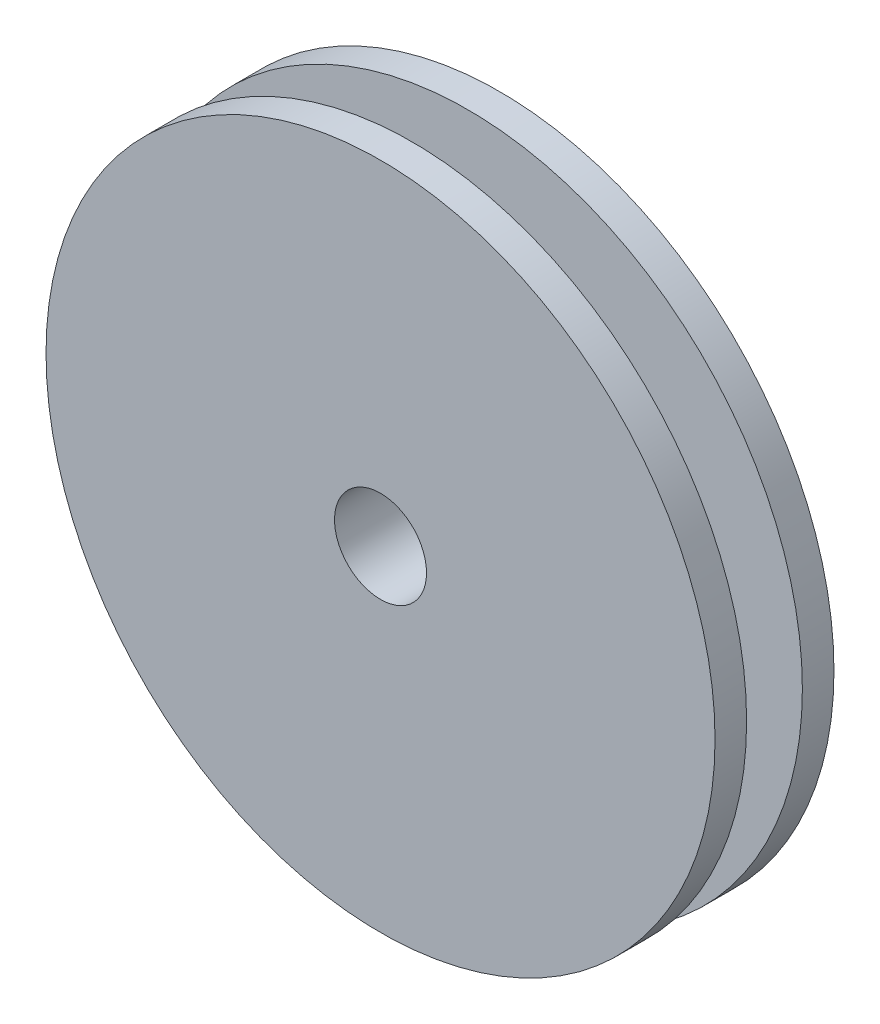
ISO-10303-21;
HEADER;
FILE_DESCRIPTION(('STEP AP214'),'2;1');
FILE_NAME('part.step','',(''),(''),'','','');
FILE_SCHEMA(('AUTOMOTIVE_DESIGN { 1 0 10303 214 1 1 1 1 }'));
ENDSEC;
DATA;
#1=APPLICATION_CONTEXT('core data for automotive mechanical design processes');
#2=APPLICATION_PROTOCOL_DEFINITION('international standard','automotive_design',2000,#1);
#3=PRODUCT_CONTEXT('',#1,'mechanical');
#4=PRODUCT('Part','Part','',(#3));
#5=PRODUCT_RELATED_PRODUCT_CATEGORY('part','',(#4));
#6=PRODUCT_DEFINITION_FORMATION('','',#4);
#7=PRODUCT_DEFINITION_CONTEXT('part definition',#1,'design');
#8=PRODUCT_DEFINITION('design','',#6,#7);
#9=PRODUCT_DEFINITION_SHAPE('','',#8);
#10=(LENGTH_UNIT() NAMED_UNIT(*) SI_UNIT(.MILLI.,.METRE.));
#11=(NAMED_UNIT(*) PLANE_ANGLE_UNIT() SI_UNIT($,.RADIAN.));
#12=(NAMED_UNIT(*) SI_UNIT($,.STERADIAN.) SOLID_ANGLE_UNIT());
#13=UNCERTAINTY_MEASURE_WITH_UNIT(LENGTH_MEASURE(1.E-05),#10,'distance_accuracy_value','');
#14=(GEOMETRIC_REPRESENTATION_CONTEXT(3) GLOBAL_UNCERTAINTY_ASSIGNED_CONTEXT((#13)) GLOBAL_UNIT_ASSIGNED_CONTEXT((#10,
#11,#12)) REPRESENTATION_CONTEXT('',''));
#15=CARTESIAN_POINT('',(0.,0.,0.));
#16=DIRECTION('',(0.,0.,1.));
#17=DIRECTION('',(1.,0.,0.));
#18=AXIS2_PLACEMENT_3D('',#15,#16,#17);
#19=CARTESIAN_POINT('',(0.,0.,36.4));
#20=DIRECTION('',(0.,0.,-1.));
#21=DIRECTION('',(-1.,0.,0.));
#22=AXIS2_PLACEMENT_3D('',#19,#20,#21);
#23=CYLINDRICAL_SURFACE('',#22,18.);
#24=CARTESIAN_POINT('',(0.,0.,30.));
#25=DIRECTION('',(0.,0.,1.));
#26=DIRECTION('',(1.,0.,0.));
#27=AXIS2_PLACEMENT_3D('',#24,#25,#26);
#28=CIRCLE('',#27,18.);
#29=CARTESIAN_POINT('',(18.,0.,30.));
#30=VERTEX_POINT('',#29);
#31=EDGE_CURVE('E44',#30,#30,#28,.T.);
#32=ORIENTED_EDGE('',*,*,#31,.T.);
#33=EDGE_LOOP('',(#32));
#34=FACE_BOUND('',#33,.T.);
#35=CARTESIAN_POINT('',(0.,0.,31.7));
#36=DIRECTION('',(0.,0.,1.));
#37=DIRECTION('',(1.,0.,0.));
#38=AXIS2_PLACEMENT_3D('',#35,#36,#37);
#39=CIRCLE('',#38,18.);
#40=CARTESIAN_POINT('',(18.,0.,31.7));
#41=VERTEX_POINT('',#40);
#42=EDGE_CURVE('E56',#41,#41,#39,.T.);
#43=ORIENTED_EDGE('',*,*,#42,.F.);
#44=EDGE_LOOP('',(#43));
#45=FACE_BOUND('',#44,.T.);
#46=ADVANCED_FACE('F36',(#34,#45),#23,.T.);
#47=CARTESIAN_POINT('',(0.,0.,34.7));
#48=DIRECTION('',(0.,0.,1.));
#49=DIRECTION('',(1.,0.,0.));
#50=AXIS2_PLACEMENT_3D('',#47,#48,#49);
#51=CIRCLE('',#50,18.);
#52=CARTESIAN_POINT('',(18.,0.,34.7));
#53=VERTEX_POINT('',#52);
#54=EDGE_CURVE('E53',#53,#53,#51,.T.);
#55=ORIENTED_EDGE('',*,*,#54,.T.);
#56=EDGE_LOOP('',(#55));
#57=FACE_BOUND('',#56,.T.);
#58=CARTESIAN_POINT('',(0.,0.,36.4));
#59=DIRECTION('',(0.,0.,1.));
#60=DIRECTION('',(1.,0.,0.));
#61=AXIS2_PLACEMENT_3D('',#58,#59,#60);
#62=CIRCLE('',#61,18.);
#63=CARTESIAN_POINT('',(18.,0.,36.4));
#64=VERTEX_POINT('',#63);
#65=EDGE_CURVE('E10',#64,#64,#62,.T.);
#66=ORIENTED_EDGE('',*,*,#65,.F.);
#67=EDGE_LOOP('',(#66));
#68=FACE_BOUND('',#67,.T.);
#69=ADVANCED_FACE('F38',(#57,#68),#23,.T.);
#70=CARTESIAN_POINT('',(0.,0.,36.4));
#71=DIRECTION('',(0.,0.,1.));
#72=DIRECTION('',(1.,0.,0.));
#73=AXIS2_PLACEMENT_3D('',#70,#71,#72);
#74=PLANE('',#73);
#75=CARTESIAN_POINT('',(0.,0.,36.4));
#76=DIRECTION('',(0.,0.,1.));
#77=DIRECTION('',(1.,0.,0.));
#78=AXIS2_PLACEMENT_3D('',#75,#76,#77);
#79=CIRCLE('',#78,2.475);
#80=CARTESIAN_POINT('',(2.475,0.,36.4));
#81=VERTEX_POINT('',#80);
#82=EDGE_CURVE('E49',#81,#81,#79,.F.);
#83=ORIENTED_EDGE('',*,*,#82,.T.);
#84=EDGE_LOOP('',(#83));
#85=FACE_BOUND('',#84,.T.);
#86=ORIENTED_EDGE('',*,*,#65,.T.);
#87=EDGE_LOOP('',(#86));
#88=FACE_BOUND('',#87,.T.);
#89=ADVANCED_FACE('F82',(#85,#88),#74,.T.);
#90=CARTESIAN_POINT('',(0.,0.,30.));
#91=DIRECTION('',(0.,0.,1.));
#92=DIRECTION('',(1.,0.,0.));
#93=AXIS2_PLACEMENT_3D('',#90,#91,#92);
#94=PLANE('',#93);
#95=CARTESIAN_POINT('',(0.,0.,30.));
#96=DIRECTION('',(0.,0.,1.));
#97=DIRECTION('',(1.,0.,0.));
#98=AXIS2_PLACEMENT_3D('',#95,#96,#97);
#99=CIRCLE('',#98,2.475);
#100=CARTESIAN_POINT('',(2.475,0.,30.));
#101=VERTEX_POINT('',#100);
#102=EDGE_CURVE('E40',#101,#101,#99,.F.);
#103=ORIENTED_EDGE('',*,*,#102,.F.);
#104=EDGE_LOOP('',(#103));
#105=FACE_BOUND('',#104,.T.);
#106=ORIENTED_EDGE('',*,*,#31,.F.);
#107=EDGE_LOOP('',(#106));
#108=FACE_BOUND('',#107,.T.);
#109=ADVANCED_FACE('F86',(#105,#108),#94,.F.);
#110=CARTESIAN_POINT('',(0.,0.,53.4));
#111=DIRECTION('',(0.,0.,-1.));
#112=DIRECTION('',(-1.,0.,0.));
#113=AXIS2_PLACEMENT_3D('',#110,#111,#112);
#114=CYLINDRICAL_SURFACE('',#113,2.475);
#115=ORIENTED_EDGE('',*,*,#82,.F.);
#116=EDGE_LOOP('',(#115));
#117=FACE_BOUND('',#116,.T.);
#118=ORIENTED_EDGE('',*,*,#102,.T.);
#119=EDGE_LOOP('',(#118));
#120=FACE_BOUND('',#119,.T.);
#121=ADVANCED_FACE('F73',(#117,#120),#114,.F.);
#122=CARTESIAN_POINT('',(0.,0.,31.7));
#123=DIRECTION('',(0.,0.,1.));
#124=DIRECTION('',(1.,0.,0.));
#125=AXIS2_PLACEMENT_3D('',#122,#123,#124);
#126=PLANE('',#125);
#127=CARTESIAN_POINT('',(0.,0.,31.7));
#128=DIRECTION('',(0.,0.,1.));
#129=DIRECTION('',(1.,0.,0.));
#130=AXIS2_PLACEMENT_3D('',#127,#128,#129);
#131=CIRCLE('',#130,13.);
#132=CARTESIAN_POINT('',(13.,0.,31.7));
#133=VERTEX_POINT('',#132);
#134=EDGE_CURVE('E57',#133,#133,#131,.T.);
#135=ORIENTED_EDGE('',*,*,#134,.F.);
#136=EDGE_LOOP('',(#135));
#137=FACE_BOUND('',#136,.T.);
#138=ORIENTED_EDGE('',*,*,#42,.T.);
#139=EDGE_LOOP('',(#138));
#140=FACE_BOUND('',#139,.T.);
#141=ADVANCED_FACE('F69',(#137,#140),#126,.T.);
#142=CARTESIAN_POINT('',(0.,0.,34.7));
#143=DIRECTION('',(0.,0.,1.));
#144=DIRECTION('',(1.,0.,0.));
#145=AXIS2_PLACEMENT_3D('',#142,#143,#144);
#146=PLANE('',#145);
#147=CARTESIAN_POINT('',(0.,0.,34.7));
#148=DIRECTION('',(0.,0.,1.));
#149=DIRECTION('',(1.,0.,0.));
#150=AXIS2_PLACEMENT_3D('',#147,#148,#149);
#151=CIRCLE('',#150,13.);
#152=CARTESIAN_POINT('',(13.,0.,34.7));
#153=VERTEX_POINT('',#152);
#154=EDGE_CURVE('E60',#153,#153,#151,.T.);
#155=ORIENTED_EDGE('',*,*,#154,.T.);
#156=EDGE_LOOP('',(#155));
#157=FACE_BOUND('',#156,.T.);
#158=ORIENTED_EDGE('',*,*,#54,.F.);
#159=EDGE_LOOP('',(#158));
#160=FACE_BOUND('',#159,.T.);
#161=ADVANCED_FACE('F72',(#157,#160),#146,.F.);
#162=CARTESIAN_POINT('',(0.,0.,31.7));
#163=DIRECTION('',(0.,0.,1.));
#164=DIRECTION('',(1.,0.,0.));
#165=AXIS2_PLACEMENT_3D('',#162,#163,#164);
#166=CYLINDRICAL_SURFACE('',#165,13.);
#167=ORIENTED_EDGE('',*,*,#134,.T.);
#168=EDGE_LOOP('',(#167));
#169=FACE_BOUND('',#168,.T.);
#170=ORIENTED_EDGE('',*,*,#154,.F.);
#171=EDGE_LOOP('',(#170));
#172=FACE_BOUND('',#171,.T.);
#173=ADVANCED_FACE('F66',(#169,#172),#166,.T.);
#174=CLOSED_SHELL('',(#46,#69,#89,#109,#121,#141,#161,#173));
#175=MANIFOLD_SOLID_BREP('B2',#174);
#176=ADVANCED_BREP_SHAPE_REPRESENTATION('',(#18,#175),#14);
#177=SHAPE_DEFINITION_REPRESENTATION(#9,#176);
ENDSEC;
END-ISO-10303-21;
